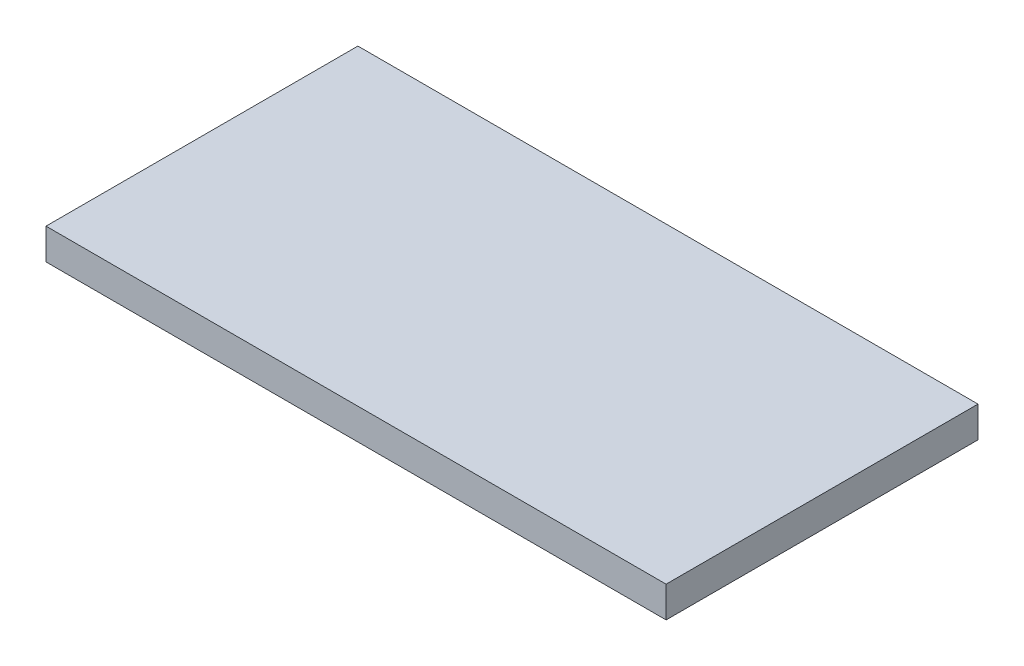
from build123d import *

# Parameters (mm, degrees)
SKETCH3_W      = 200.058212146
SKETCH3_H      = 100.625927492
EXTRUDE1_DEPTH = 10


with BuildPart() as part:
    # Sketch3 → Extrude1 (new body)
    with BuildSketch(Plane(origin=(0, 0, 0), x_dir=(1, 0, 0), z_dir=(0, 1, 0))):
        with Locations((79.800284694, -6.449275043)):
            Rectangle(SKETCH3_W, SKETCH3_H)
    extrude(amount=-EXTRUDE1_DEPTH)


solid = part.part
